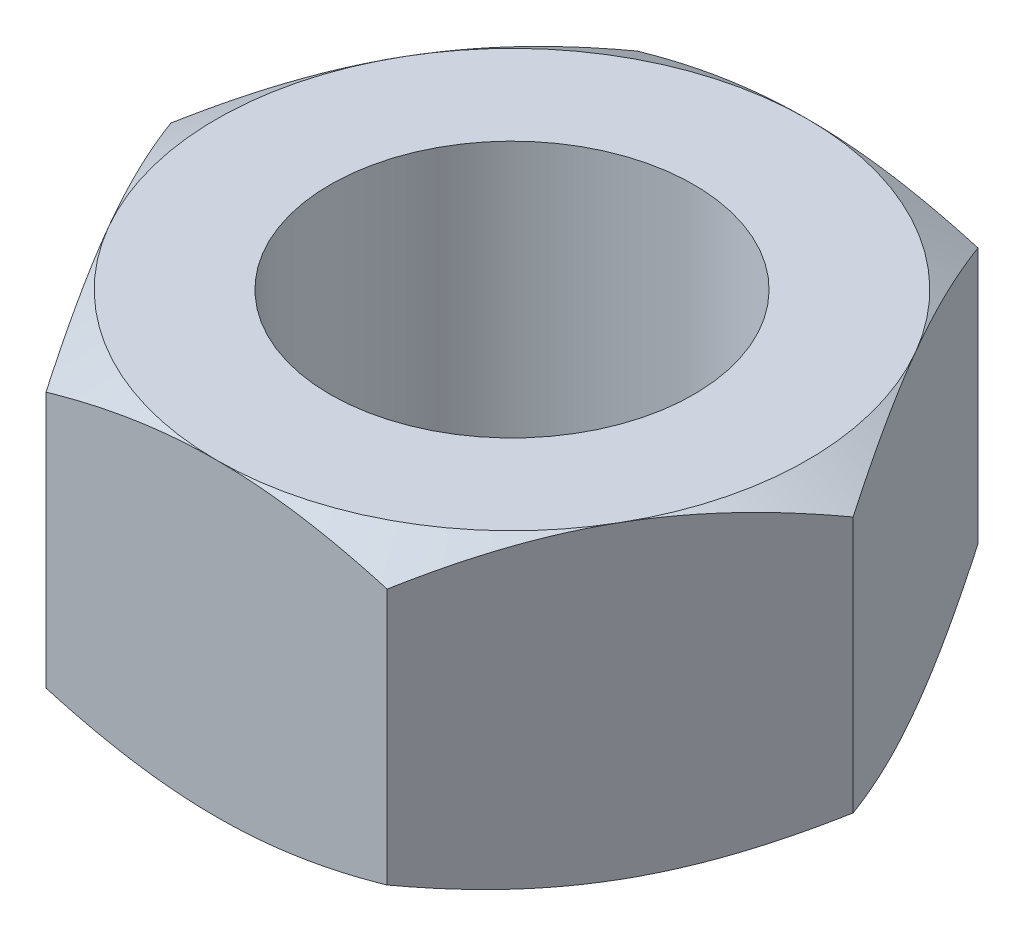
from build123d import *

# Parameters (mm, degrees)
BOSS_EXTRUDE1_DEPTH     = 3.4
SKETCH2_OUTSIDE_W       = 44.766
SKETCH2_OUTSIDE_H       = 42.754
SKETCH2_OUTSIDE_R       = 6.5
CUT_EXTRUDE1_DEPTH      = 6.8
CUT_EXTRUDE1_DRAFT      = -60
MIRROR1_COPY_1_SKETCH_W = 44.766
MIRROR1_COPY_1_SKETCH_H = 42.754
MIRROR1_COPY_1_SKETCH_R = 6.5
MIRROR1_COPY_1_DEPTH    = 6.8
MIRROR1_COPY_1_DRAFT    = -60
SKETCH3_R               = 4
CUT_EXTRUDE2_DEPTH      = 6.8


with BuildPart() as part:
    # Sketch1 → Boss-Extrude1 (new, symmetric)
    with BuildSketch(Plane(origin=(0, 0, 0), x_dir=(1, 0, 0), z_dir=(0, 1, 0))):
        Polygon((7.505553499, 0), (3.75277675, 6.5), (-3.75277675, 6.5), (-7.505553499, 0), (-3.75277675, -6.5), (3.75277675, -6.5), align=None)
    extrude(amount=BOSS_EXTRUDE1_DEPTH, both=True)


with BuildPart() as cut_extrude1_tool:
    # Sketch2 outside → Cut-Extrude1 (with draft: the straight prism first)
    with BuildSketch(Plane(origin=(0, 3.4, 0), x_dir=(1, 0, 0), z_dir=(0, 1, 0))):
        Rectangle(SKETCH2_OUTSIDE_W, SKETCH2_OUTSIDE_H)
        Circle(SKETCH2_OUTSIDE_R, mode=Mode.SUBTRACT)
    extrude(amount=-CUT_EXTRUDE1_DEPTH)
    # Cut-Extrude1: the draft: its side faces are tilted about the plane it starts from
    cut_extrude1_sides = [cut_extrude1_tool.faces().sort_by_distance(p)[0] for p in [
        (0, 0, 21.377),
        (22.383, 0, 0),
        (0, 0, -21.377),
        (-22.383, 0, 0),
        (-6.5, 0, 0),
    ]]
    draft(cut_extrude1_sides, Plane(origin=(0, 3.4, 0), x_dir=(1, 0, 0), z_dir=(0, 1, 0)), CUT_EXTRUDE1_DRAFT)


with BuildPart() as part_1:
    add(part.part)

    # Cut-Extrude1: cut by cut_extrude1_tool
    add(cut_extrude1_tool.part, mode=Mode.SUBTRACT)


with BuildPart() as mirror1_copy_1_tool:
    # Mirror1 copy 1 sketch → Mirror1 copy 1 (with draft: the straight prism first)
    with BuildSketch(Plane.XZ.offset(3.4)):
        Rectangle(MIRROR1_COPY_1_SKETCH_W, MIRROR1_COPY_1_SKETCH_H)
        Circle(MIRROR1_COPY_1_SKETCH_R, mode=Mode.SUBTRACT)
    extrude(amount=-MIRROR1_COPY_1_DEPTH)
    # Mirror1 copy 1: the draft: its side faces are tilted about the plane it starts from
    mirror1_copy_1_sides = [mirror1_copy_1_tool.faces().sort_by_distance(p)[0] for p in [
        (0, 0, 21.377),
        (22.383, 0, 0),
        (0, 0, -21.377),
        (-22.383, 0, 0),
        (-6.5, 0, 0),
    ]]
    draft(mirror1_copy_1_sides, Plane.XZ.offset(3.4), MIRROR1_COPY_1_DRAFT)


with BuildPart() as part_2:
    add(part_1.part)

    # Mirror1 copy 1: cut by mirror1_copy_1_tool
    add(mirror1_copy_1_tool.part, mode=Mode.SUBTRACT)

    # Sketch3 → Cut-Extrude2 (cut)
    with BuildSketch(Plane(origin=(0, 3.4, 0), x_dir=(1, 0, 0), z_dir=(0, 1, 0))):
        with Locations(Location((0, 0, 0), (0, 0, 270))):
            Circle(SKETCH3_R)
    extrude(amount=-CUT_EXTRUDE2_DEPTH, mode=Mode.SUBTRACT)


solid = part_2.part
